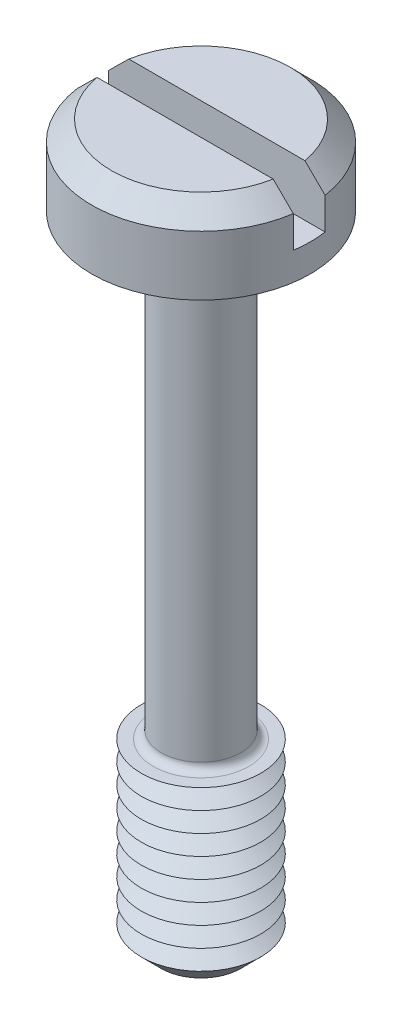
ISO-10303-21;
HEADER;
FILE_DESCRIPTION(('STEP AP214'),'2;1');
FILE_NAME('part.step','',(''),(''),'','','');
FILE_SCHEMA(('AUTOMOTIVE_DESIGN { 1 0 10303 214 1 1 1 1 }'));
ENDSEC;
DATA;
#1=APPLICATION_CONTEXT('core data for automotive mechanical design processes');
#2=APPLICATION_PROTOCOL_DEFINITION('international standard','automotive_design',2000,#1);
#3=PRODUCT_CONTEXT('',#1,'mechanical');
#4=PRODUCT('Part','Part','',(#3));
#5=PRODUCT_RELATED_PRODUCT_CATEGORY('part','',(#4));
#6=PRODUCT_DEFINITION_FORMATION('','',#4);
#7=PRODUCT_DEFINITION_CONTEXT('part definition',#1,'design');
#8=PRODUCT_DEFINITION('design','',#6,#7);
#9=PRODUCT_DEFINITION_SHAPE('','',#8);
#10=(LENGTH_UNIT() NAMED_UNIT(*) SI_UNIT(.MILLI.,.METRE.));
#11=(NAMED_UNIT(*) PLANE_ANGLE_UNIT() SI_UNIT($,.RADIAN.));
#12=(NAMED_UNIT(*) SI_UNIT($,.STERADIAN.) SOLID_ANGLE_UNIT());
#13=UNCERTAINTY_MEASURE_WITH_UNIT(LENGTH_MEASURE(1.E-05),#10,'distance_accuracy_value','');
#14=(GEOMETRIC_REPRESENTATION_CONTEXT(3) GLOBAL_UNCERTAINTY_ASSIGNED_CONTEXT((#13)) GLOBAL_UNIT_ASSIGNED_CONTEXT((#10,
#11,#12)) REPRESENTATION_CONTEXT('',''));
#15=CARTESIAN_POINT('',(0.,0.,0.));
#16=DIRECTION('',(0.,0.,1.));
#17=DIRECTION('',(1.,0.,0.));
#18=AXIS2_PLACEMENT_3D('',#15,#16,#17);
#19=CARTESIAN_POINT('',(0.,2.,0.));
#20=DIRECTION('',(0.,1.,0.));
#21=DIRECTION('',(0.,0.,1.));
#22=AXIS2_PLACEMENT_3D('',#19,#20,#21);
#23=PLANE('',#22);
#24=DIRECTION('',(-1.,0.,0.));
#25=VECTOR('',#24,1.);
#26=CARTESIAN_POINT('',(2.75,2.,-0.4));
#27=LINE('',#26,#25);
#28=CARTESIAN_POINT('',(2.21415898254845,2.,-0.4));
#29=VERTEX_POINT('',#28);
#30=CARTESIAN_POINT('',(-2.21415898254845,2.,-0.4));
#31=VERTEX_POINT('',#30);
#32=EDGE_CURVE('E110',#29,#31,#27,.T.);
#33=ORIENTED_EDGE('',*,*,#32,.F.);
#34=CARTESIAN_POINT('',(0.,2.,0.));
#35=DIRECTION('',(0.,1.,0.));
#36=DIRECTION('',(0.,0.,1.));
#37=AXIS2_PLACEMENT_3D('',#34,#35,#36);
#38=CIRCLE('',#37,2.25);
#39=EDGE_CURVE('E113',#29,#31,#38,.T.);
#40=ORIENTED_EDGE('',*,*,#39,.T.);
#41=EDGE_LOOP('',(#33,#40));
#42=FACE_BOUND('',#41,.T.);
#43=ADVANCED_FACE('F39',(#42),#23,.T.);
#44=CARTESIAN_POINT('',(0.,2.,0.));
#45=DIRECTION('',(0.,-1.,0.));
#46=DIRECTION('',(0.,0.,-1.));
#47=AXIS2_PLACEMENT_3D('',#44,#45,#46);
#48=CONICAL_SURFACE('',#47,2.25,0.785398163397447);
#49=CARTESIAN_POINT('',(6.05060089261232,-1.81380830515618,-0.4));
#50=CARTESIAN_POINT('',(5.84217393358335,-1.60583904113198,-0.4));
#51=CARTESIAN_POINT('',(5.63372707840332,-1.3978896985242,-0.4));
#52=CARTESIAN_POINT('',(5.21676338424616,-0.982052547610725,-0.4));
#53=CARTESIAN_POINT('',(5.0082465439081,-0.774164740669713,-0.4));
#54=CARTESIAN_POINT('',(4.59102343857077,-0.358383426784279,-0.4));
#55=CARTESIAN_POINT('',(4.38231713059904,-0.1504899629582,-0.4));
#56=CARTESIAN_POINT('',(3.96477014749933,0.265153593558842,-0.4));
#57=CARTESIAN_POINT('',(3.75592947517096,0.47290368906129,-0.4));
#58=CARTESIAN_POINT('',(3.33589913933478,0.890287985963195,-0.4));
#59=CARTESIAN_POINT('',(3.12470717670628,1.09991987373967,-0.4));
#60=CARTESIAN_POINT('',(2.7019134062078,1.51879562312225,-0.4));
#61=CARTESIAN_POINT('',(2.49031157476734,1.72803946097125,-0.4));
#62=CARTESIAN_POINT('',(2.17231429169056,2.04123939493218,-0.4));
#63=CARTESIAN_POINT('',(2.06623184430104,2.14551302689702,-0.4));
#64=CARTESIAN_POINT('',(1.85373145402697,2.35372301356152,-0.4));
#65=CARTESIAN_POINT('',(1.74731350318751,2.45765936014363,-0.4));
#66=CARTESIAN_POINT('',(1.53394692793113,2.6649644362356,-0.4));
#67=CARTESIAN_POINT('',(1.42699836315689,2.76833322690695,-0.4));
#68=CARTESIAN_POINT('',(1.26580938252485,2.92258234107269,-0.4));
#69=CARTESIAN_POINT('',(1.21195308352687,2.97386371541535,-0.4));
#70=CARTESIAN_POINT('',(1.10386632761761,3.07603025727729,-0.4));
#71=CARTESIAN_POINT('',(1.0496358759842,3.12691543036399,-0.4));
#72=CARTESIAN_POINT('',(0.965529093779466,3.20495157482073,-0.4));
#73=CARTESIAN_POINT('',(0.935852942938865,3.23231811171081,-0.4));
#74=CARTESIAN_POINT('',(0.876282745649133,3.28681446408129,-0.4));
#75=CARTESIAN_POINT('',(0.846388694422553,3.31394427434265,-0.4));
#76=CARTESIAN_POINT('',(0.786319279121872,3.36788760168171,-0.4));
#77=CARTESIAN_POINT('',(0.75614393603,3.39470114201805,-0.4));
#78=CARTESIAN_POINT('',(0.695411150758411,3.44788757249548,-0.4));
#79=CARTESIAN_POINT('',(0.664853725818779,3.4742604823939,-0.4));
#80=CARTESIAN_POINT('',(0.587773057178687,3.53947080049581,-0.4));
#81=CARTESIAN_POINT('',(0.540923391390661,3.57793090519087,-0.4));
#82=CARTESIAN_POINT('',(0.469108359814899,3.63368803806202,-0.4));
#83=CARTESIAN_POINT('',(0.444902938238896,3.65195872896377,-0.4));
#84=CARTESIAN_POINT('',(0.39579650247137,3.68753467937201,-0.4));
#85=CARTESIAN_POINT('',(0.370895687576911,3.70484021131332,-0.4));
#86=CARTESIAN_POINT('',(0.315135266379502,3.74129905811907,-0.4));
#87=CARTESIAN_POINT('',(0.284069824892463,3.76014262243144,-0.4));
#88=CARTESIAN_POINT('',(0.220007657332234,3.79429188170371,-0.4));
#89=CARTESIAN_POINT('',(0.187014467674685,3.80960381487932,-0.4));
#90=CARTESIAN_POINT('',(0.129469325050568,3.83013103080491,-0.4));
#91=CARTESIAN_POINT('',(0.105533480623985,3.83700748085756,-0.4));
#92=CARTESIAN_POINT('',(0.0568861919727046,3.8466714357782,-0.4));
#93=CARTESIAN_POINT('',(0.0321777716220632,3.84947323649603,-0.4));
#94=CARTESIAN_POINT('',(-0.0174556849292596,3.8503913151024,-0.4));
#95=CARTESIAN_POINT('',(-0.0423811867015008,3.84848412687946,-0.4));
#96=CARTESIAN_POINT('',(-0.0915464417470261,3.8403829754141,-0.4));
#97=CARTESIAN_POINT('',(-0.11578417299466,3.83417751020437,-0.4));
#98=CARTESIAN_POINT('',(-0.164015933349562,3.81830420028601,-0.4));
#99=CARTESIAN_POINT('',(-0.187969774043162,3.80851974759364,-0.4));
#100=CARTESIAN_POINT('',(-0.234812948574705,3.78663483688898,-0.4));
#101=CARTESIAN_POINT('',(-0.25770025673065,3.77453017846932,-0.4));
#102=CARTESIAN_POINT('',(-0.302761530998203,3.74868049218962,-0.4));
#103=CARTESIAN_POINT('',(-0.324928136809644,3.73492286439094,-0.4));
#104=CARTESIAN_POINT('',(-0.368536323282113,3.70635481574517,-0.4));
#105=CARTESIAN_POINT('',(-0.389978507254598,3.69154530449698,-0.4));
#106=CARTESIAN_POINT('',(-0.457169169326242,3.64340388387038,-0.4));
#107=CARTESIAN_POINT('',(-0.501937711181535,3.60871473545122,-0.4));
#108=CARTESIAN_POINT('',(-0.590074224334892,3.53759028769,-0.4));
#109=CARTESIAN_POINT('',(-0.633441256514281,3.50115385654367,-0.4));
#110=CARTESIAN_POINT('',(-0.719371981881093,3.42718980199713,-0.4));
#111=CARTESIAN_POINT('',(-0.761934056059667,3.38966030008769,-0.4));
#112=CARTESIAN_POINT('',(-0.84646547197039,3.31396862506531,-0.4));
#113=CARTESIAN_POINT('',(-0.888434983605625,3.27580664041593,-0.4));
#114=CARTESIAN_POINT('',(-1.01351008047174,3.16091722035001,-0.4));
#115=CARTESIAN_POINT('',(-1.09603733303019,3.08356131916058,-0.4));
#116=CARTESIAN_POINT('',(-1.26020205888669,2.92809304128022,-0.4));
#117=CARTESIAN_POINT('',(-1.34184039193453,2.84998156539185,-0.4));
#118=CARTESIAN_POINT('',(-1.50425180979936,2.69362860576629,-0.4));
#119=CARTESIAN_POINT('',(-1.58502715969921,2.61538947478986,-0.4));
#120=CARTESIAN_POINT('',(-1.74627332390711,2.4585978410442,-0.4));
#121=CARTESIAN_POINT('',(-1.82674413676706,2.38004533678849,-0.4));
#122=CARTESIAN_POINT('',(-2.06785619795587,2.14407469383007,-0.4));
#123=CARTESIAN_POINT('',(-2.22819388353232,1.98634651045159,-0.4));
#124=CARTESIAN_POINT('',(-2.54852691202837,1.67040441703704,-0.4));
#125=CARTESIAN_POINT('',(-2.70852207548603,1.51219032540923,-0.4));
#126=CARTESIAN_POINT('',(-3.02826273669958,1.19551306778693,-0.4));
#127=CARTESIAN_POINT('',(-3.18800823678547,1.03704990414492,-0.4));
#128=CARTESIAN_POINT('',(-3.66699080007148,0.561455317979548,-0.4));
#129=CARTESIAN_POINT('',(-3.98599924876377,0.244093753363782,-0.4));
#130=CARTESIAN_POINT('',(-4.62369880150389,-0.390879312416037,-0.4));
#131=CARTESIAN_POINT('',(-4.94238993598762,-0.7084907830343,-0.4));
#132=CARTESIAN_POINT('',(-5.39262624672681,-1.15743192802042,-0.4));
#133=CARTESIAN_POINT('',(-5.52423897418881,-1.28869385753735,-0.4));
#134=CARTESIAN_POINT('',(-5.78743776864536,-1.55123695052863,-0.4));
#135=CARTESIAN_POINT('',(-5.91902383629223,-1.68251811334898,-0.4));
#136=CARTESIAN_POINT('',(-6.05060089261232,-1.81380830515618,-0.4));
#137=B_SPLINE_CURVE_WITH_KNOTS('',3,(#49,#50,#51,#52,#53,#54,#55,#56,#57,#58,#59,#60,#61,#62,
#63,#64,#65,#66,#67,#68,#69,#70,#71,#72,#73,#74,#75,#76,#77,#78,#79,#80,#81,#82,#83,#84,#85,#86,
#87,#88,#89,#90,#91,#92,#93,#94,#95,#96,#97,#98,#99,#100,#101,#102,#103,#104,#105,#106,#107,
#108,#109,#110,#111,#112,#113,#114,#115,#116,#117,#118,#119,#120,#121,#122,#123,#124,#125,#126,
#127,#128,#129,#130,#131,#132,#133,#134,#135,#136),.UNSPECIFIED.,.F.,.F.,(4,2,2,2,2,2,2,2,2,2,2,
2,2,2,2,2,2,2,2,2,2,2,2,2,2,2,2,2,2,2,2,2,2,2,2,2,2,2,2,2,2,2,2,4),(0.,0.883310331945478,
1.76663897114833,2.65038219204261,3.53410755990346,4.42681573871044,5.31957687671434,
5.76582544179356,6.21208466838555,6.65829482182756,6.88139126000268,7.10448455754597,
7.22558850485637,7.34669511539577,7.46779276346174,7.58888496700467,7.77066509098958,
7.86163037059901,7.95256984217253,8.06146372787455,8.17016376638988,8.24461141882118,
8.31879723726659,8.39335348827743,8.46811002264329,8.54555790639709,8.62314734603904,
8.70137101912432,8.77952785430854,8.94932745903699,9.11923857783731,9.28946128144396,
9.45963414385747,9.79895964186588,10.1379210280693,10.475282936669,10.8126464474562,
11.4873867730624,12.1624208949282,12.8374486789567,14.1873973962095,15.5372009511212,
16.0948428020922,16.6524687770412),.UNSPECIFIED.);
#138=CARTESIAN_POINT('',(2.72075357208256,1.5,-0.4));
#139=VERTEX_POINT('',#138);
#140=EDGE_CURVE('E259',#139,#29,#137,.T.);
#141=ORIENTED_EDGE('',*,*,#140,.F.);
#142=CARTESIAN_POINT('',(0.,1.5,0.));
#143=DIRECTION('',(0.,1.,0.));
#144=DIRECTION('',(0.,0.,1.));
#145=AXIS2_PLACEMENT_3D('',#142,#143,#144);
#146=CIRCLE('',#145,2.75);
#147=CARTESIAN_POINT('',(-2.72075357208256,1.5,-0.4));
#148=VERTEX_POINT('',#147);
#149=EDGE_CURVE('E127',#148,#139,#146,.F.);
#150=ORIENTED_EDGE('',*,*,#149,.F.);
#151=EDGE_CURVE('E102',#31,#148,#137,.T.);
#152=ORIENTED_EDGE('',*,*,#151,.F.);
#153=ORIENTED_EDGE('',*,*,#39,.F.);
#154=EDGE_LOOP('',(#141,#150,#152,#153));
#155=FACE_BOUND('',#154,.T.);
#156=ADVANCED_FACE('F221',(#155),#48,.T.);
#157=CARTESIAN_POINT('',(0.,-16.,0.));
#158=DIRECTION('',(0.,1.,0.));
#159=DIRECTION('',(0.,0.,1.));
#160=AXIS2_PLACEMENT_3D('',#157,#158,#159);
#161=CYLINDRICAL_SURFACE('',#160,1.);
#162=CARTESIAN_POINT('',(0.,-11.3,0.));
#163=DIRECTION('',(0.,-1.,0.));
#164=DIRECTION('',(0.,0.,-1.));
#165=AXIS2_PLACEMENT_3D('',#162,#163,#164);
#166=CIRCLE('',#165,1.);
#167=CARTESIAN_POINT('',(0.,-11.3,-1.));
#168=VERTEX_POINT('',#167);
#169=EDGE_CURVE('E122',#168,#168,#166,.F.);
#170=ORIENTED_EDGE('',*,*,#169,.T.);
#171=EDGE_LOOP('',(#170));
#172=FACE_BOUND('',#171,.T.);
#173=CARTESIAN_POINT('',(0.,-0.199999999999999,0.));
#174=DIRECTION('',(0.,1.,0.));
#175=DIRECTION('',(0.,0.,1.));
#176=AXIS2_PLACEMENT_3D('',#173,#174,#175);
#177=CIRCLE('',#176,1.);
#178=CARTESIAN_POINT('',(0.,-0.199999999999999,1.));
#179=VERTEX_POINT('',#178);
#180=EDGE_CURVE('E365',#179,#179,#177,.F.);
#181=ORIENTED_EDGE('',*,*,#180,.T.);
#182=EDGE_LOOP('',(#181));
#183=FACE_BOUND('',#182,.T.);
#184=ADVANCED_FACE('F217',(#172,#183),#161,.T.);
#185=CARTESIAN_POINT('',(0.,2.,0.));
#186=DIRECTION('',(0.,-1.,0.));
#187=DIRECTION('',(0.,0.,-1.));
#188=AXIS2_PLACEMENT_3D('',#185,#186,#187);
#189=CYLINDRICAL_SURFACE('',#188,2.75);
#190=ORIENTED_EDGE('',*,*,#149,.T.);
#191=DIRECTION('',(0.,-1.,0.));
#192=VECTOR('',#191,1.);
#193=CARTESIAN_POINT('',(2.72075357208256,2.,-0.4));
#194=LINE('',#193,#192);
#195=CARTESIAN_POINT('',(2.72075357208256,0.7,-0.4));
#196=VERTEX_POINT('',#195);
#197=EDGE_CURVE('E64',#139,#196,#194,.T.);
#198=ORIENTED_EDGE('',*,*,#197,.T.);
#199=CARTESIAN_POINT('',(0.,0.7,0.));
#200=DIRECTION('',(0.,1.,0.));
#201=DIRECTION('',(0.,0.,1.));
#202=AXIS2_PLACEMENT_3D('',#199,#200,#201);
#203=CIRCLE('',#202,2.75);
#204=CARTESIAN_POINT('',(2.72075357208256,0.7,0.4));
#205=VERTEX_POINT('',#204);
#206=EDGE_CURVE('E11',#205,#196,#203,.T.);
#207=ORIENTED_EDGE('',*,*,#206,.F.);
#208=DIRECTION('',(0.,-1.,0.));
#209=VECTOR('',#208,1.);
#210=CARTESIAN_POINT('',(2.72075357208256,2.,0.4));
#211=LINE('',#210,#209);
#212=CARTESIAN_POINT('',(2.72075357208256,1.5,0.4));
#213=VERTEX_POINT('',#212);
#214=EDGE_CURVE('E277',#205,#213,#211,.F.);
#215=ORIENTED_EDGE('',*,*,#214,.T.);
#216=CARTESIAN_POINT('',(-2.72075357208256,1.5,0.4));
#217=VERTEX_POINT('',#216);
#218=EDGE_CURVE('E119',#213,#217,#146,.F.);
#219=ORIENTED_EDGE('',*,*,#218,.T.);
#220=DIRECTION('',(0.,-1.,0.));
#221=VECTOR('',#220,1.);
#222=CARTESIAN_POINT('',(-2.72075357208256,2.,0.4));
#223=LINE('',#222,#221);
#224=CARTESIAN_POINT('',(-2.72075357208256,0.7,0.4));
#225=VERTEX_POINT('',#224);
#226=EDGE_CURVE('E96',#217,#225,#223,.T.);
#227=ORIENTED_EDGE('',*,*,#226,.T.);
#228=CARTESIAN_POINT('',(-2.72075357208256,0.7,-0.4));
#229=VERTEX_POINT('',#228);
#230=EDGE_CURVE('E44',#229,#225,#203,.T.);
#231=ORIENTED_EDGE('',*,*,#230,.F.);
#232=DIRECTION('',(0.,-1.,0.));
#233=VECTOR('',#232,1.);
#234=CARTESIAN_POINT('',(-2.72075357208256,2.,-0.4));
#235=LINE('',#234,#233);
#236=EDGE_CURVE('E282',#229,#148,#235,.F.);
#237=ORIENTED_EDGE('',*,*,#236,.T.);
#238=EDGE_LOOP('',(#190,#198,#207,#215,#219,#227,#231,#237));
#239=FACE_BOUND('',#238,.T.);
#240=CARTESIAN_POINT('',(0.,0.,0.));
#241=DIRECTION('',(0.,1.,0.));
#242=DIRECTION('',(0.,0.,1.));
#243=AXIS2_PLACEMENT_3D('',#240,#241,#242);
#244=CIRCLE('',#243,2.75);
#245=CARTESIAN_POINT('',(0.,0.,2.75));
#246=VERTEX_POINT('',#245);
#247=EDGE_CURVE('E353',#246,#246,#244,.T.);
#248=ORIENTED_EDGE('',*,*,#247,.T.);
#249=EDGE_LOOP('',(#248));
#250=FACE_BOUND('',#249,.T.);
#251=ADVANCED_FACE('F220',(#239,#250),#189,.T.);
#252=DIRECTION('',(1.,0.,0.));
#253=VECTOR('',#252,1.);
#254=CARTESIAN_POINT('',(2.75,2.,0.4));
#255=LINE('',#254,#253);
#256=CARTESIAN_POINT('',(-2.21415898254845,2.,0.4));
#257=VERTEX_POINT('',#256);
#258=CARTESIAN_POINT('',(2.21415898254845,2.,0.4));
#259=VERTEX_POINT('',#258);
#260=EDGE_CURVE('E56',#257,#259,#255,.T.);
#261=ORIENTED_EDGE('',*,*,#260,.F.);
#262=EDGE_CURVE('E108',#257,#259,#38,.T.);
#263=ORIENTED_EDGE('',*,*,#262,.T.);
#264=EDGE_LOOP('',(#261,#263));
#265=FACE_BOUND('',#264,.T.);
#266=ADVANCED_FACE('F107',(#265),#23,.T.);
#267=CARTESIAN_POINT('',(0.,0.,0.));
#268=DIRECTION('',(0.,1.,0.));
#269=DIRECTION('',(0.,0.,1.));
#270=AXIS2_PLACEMENT_3D('',#267,#268,#269);
#271=PLANE('',#270);
#272=CARTESIAN_POINT('',(0.,0.,0.));
#273=DIRECTION('',(0.,1.,0.));
#274=DIRECTION('',(0.,0.,1.));
#275=AXIS2_PLACEMENT_3D('',#272,#273,#274);
#276=CIRCLE('',#275,1.2);
#277=CARTESIAN_POINT('',(0.,0.,1.2));
#278=VERTEX_POINT('',#277);
#279=EDGE_CURVE('E114',#278,#278,#276,.T.);
#280=ORIENTED_EDGE('',*,*,#279,.T.);
#281=EDGE_LOOP('',(#280));
#282=FACE_BOUND('',#281,.T.);
#283=ORIENTED_EDGE('',*,*,#247,.F.);
#284=EDGE_LOOP('',(#283));
#285=FACE_BOUND('',#284,.T.);
#286=ADVANCED_FACE('F211',(#282,#285),#271,.F.);
#287=CARTESIAN_POINT('',(0.,-11.5,0.));
#288=DIRECTION('',(0.,-1.,0.));
#289=DIRECTION('',(0.,0.,-1.));
#290=AXIS2_PLACEMENT_3D('',#287,#288,#289);
#291=PLANE('',#290);
#292=CARTESIAN_POINT('',(0.,-11.5,0.));
#293=DIRECTION('',(0.,-1.,0.));
#294=DIRECTION('',(0.,0.,-1.));
#295=AXIS2_PLACEMENT_3D('',#292,#293,#294);
#296=CIRCLE('',#295,1.2);
#297=CARTESIAN_POINT('',(0.,-11.5,-1.2));
#298=VERTEX_POINT('',#297);
#299=EDGE_CURVE('E361',#298,#298,#296,.T.);
#300=ORIENTED_EDGE('',*,*,#299,.T.);
#301=EDGE_LOOP('',(#300));
#302=FACE_BOUND('',#301,.T.);
#303=CARTESIAN_POINT('',(0.,-11.5,0.));
#304=DIRECTION('',(0.,1.,0.));
#305=DIRECTION('',(0.,0.,1.));
#306=AXIS2_PLACEMENT_3D('',#303,#304,#305);
#307=CIRCLE('',#306,1.5);
#308=CARTESIAN_POINT('',(0.,-11.5,1.5));
#309=VERTEX_POINT('',#308);
#310=EDGE_CURVE('E350',#309,#309,#307,.T.);
#311=ORIENTED_EDGE('',*,*,#310,.T.);
#312=EDGE_LOOP('',(#311));
#313=FACE_BOUND('',#312,.T.);
#314=ADVANCED_FACE('F207',(#302,#313),#291,.F.);
#315=CARTESIAN_POINT('',(0.,-11.75,0.));
#316=DIRECTION('',(0.,1.,0.));
#317=DIRECTION('',(0.,0.,1.));
#318=AXIS2_PLACEMENT_3D('',#315,#316,#317);
#319=CONICAL_SURFACE('',#318,1.06698729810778,1.0471975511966);
#320=ORIENTED_EDGE('',*,*,#310,.F.);
#321=EDGE_LOOP('',(#320));
#322=FACE_BOUND('',#321,.T.);
#323=CARTESIAN_POINT('',(0.,-11.75,0.));
#324=DIRECTION('',(0.,1.,0.));
#325=DIRECTION('',(0.,0.,1.));
#326=AXIS2_PLACEMENT_3D('',#323,#324,#325);
#327=CIRCLE('',#326,1.06698729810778);
#328=CARTESIAN_POINT('',(0.,-11.75,1.06698729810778));
#329=VERTEX_POINT('',#328);
#330=EDGE_CURVE('E346',#329,#329,#327,.T.);
#331=ORIENTED_EDGE('',*,*,#330,.T.);
#332=EDGE_LOOP('',(#331));
#333=FACE_BOUND('',#332,.T.);
#334=ADVANCED_FACE('F203',(#322,#333),#319,.T.);
#335=CARTESIAN_POINT('',(0.,-12.,0.));
#336=DIRECTION('',(0.,-1.,0.));
#337=DIRECTION('',(0.,0.,-1.));
#338=AXIS2_PLACEMENT_3D('',#335,#336,#337);
#339=CONICAL_SURFACE('',#338,1.5,1.0471975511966);
#340=ORIENTED_EDGE('',*,*,#330,.F.);
#341=EDGE_LOOP('',(#340));
#342=FACE_BOUND('',#341,.T.);
#343=CARTESIAN_POINT('',(0.,-12.,0.));
#344=DIRECTION('',(0.,1.,0.));
#345=DIRECTION('',(0.,0.,1.));
#346=AXIS2_PLACEMENT_3D('',#343,#344,#345);
#347=CIRCLE('',#346,1.5);
#348=CARTESIAN_POINT('',(0.,-12.,1.5));
#349=VERTEX_POINT('',#348);
#350=EDGE_CURVE('E342',#349,#349,#347,.T.);
#351=ORIENTED_EDGE('',*,*,#350,.T.);
#352=EDGE_LOOP('',(#351));
#353=FACE_BOUND('',#352,.T.);
#354=ADVANCED_FACE('F199',(#342,#353),#339,.T.);
#355=CARTESIAN_POINT('',(0.,-12.25,0.));
#356=DIRECTION('',(0.,1.,0.));
#357=DIRECTION('',(0.,0.,1.));
#358=AXIS2_PLACEMENT_3D('',#355,#356,#357);
#359=CONICAL_SURFACE('',#358,1.06698729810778,1.0471975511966);
#360=ORIENTED_EDGE('',*,*,#350,.F.);
#361=EDGE_LOOP('',(#360));
#362=FACE_BOUND('',#361,.T.);
#363=CARTESIAN_POINT('',(0.,-12.25,0.));
#364=DIRECTION('',(0.,1.,0.));
#365=DIRECTION('',(0.,0.,1.));
#366=AXIS2_PLACEMENT_3D('',#363,#364,#365);
#367=CIRCLE('',#366,1.06698729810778);
#368=CARTESIAN_POINT('',(0.,-12.25,1.06698729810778));
#369=VERTEX_POINT('',#368);
#370=EDGE_CURVE('E339',#369,#369,#367,.T.);
#371=ORIENTED_EDGE('',*,*,#370,.T.);
#372=EDGE_LOOP('',(#371));
#373=FACE_BOUND('',#372,.T.);
#374=ADVANCED_FACE('F195',(#362,#373),#359,.T.);
#375=CARTESIAN_POINT('',(0.,-12.5,0.));
#376=DIRECTION('',(0.,-1.,0.));
#377=DIRECTION('',(0.,0.,-1.));
#378=AXIS2_PLACEMENT_3D('',#375,#376,#377);
#379=CONICAL_SURFACE('',#378,1.5,1.0471975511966);
#380=ORIENTED_EDGE('',*,*,#370,.F.);
#381=EDGE_LOOP('',(#380));
#382=FACE_BOUND('',#381,.T.);
#383=CARTESIAN_POINT('',(0.,-12.5,0.));
#384=DIRECTION('',(0.,1.,0.));
#385=DIRECTION('',(0.,0.,1.));
#386=AXIS2_PLACEMENT_3D('',#383,#384,#385);
#387=CIRCLE('',#386,1.5);
#388=CARTESIAN_POINT('',(0.,-12.5,1.5));
#389=VERTEX_POINT('',#388);
#390=EDGE_CURVE('E335',#389,#389,#387,.T.);
#391=ORIENTED_EDGE('',*,*,#390,.T.);
#392=EDGE_LOOP('',(#391));
#393=FACE_BOUND('',#392,.T.);
#394=ADVANCED_FACE('F191',(#382,#393),#379,.T.);
#395=CARTESIAN_POINT('',(0.,-12.75,0.));
#396=DIRECTION('',(0.,1.,0.));
#397=DIRECTION('',(0.,0.,1.));
#398=AXIS2_PLACEMENT_3D('',#395,#396,#397);
#399=CONICAL_SURFACE('',#398,1.06698729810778,1.0471975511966);
#400=ORIENTED_EDGE('',*,*,#390,.F.);
#401=EDGE_LOOP('',(#400));
#402=FACE_BOUND('',#401,.T.);
#403=CARTESIAN_POINT('',(0.,-12.75,0.));
#404=DIRECTION('',(0.,1.,0.));
#405=DIRECTION('',(0.,0.,1.));
#406=AXIS2_PLACEMENT_3D('',#403,#404,#405);
#407=CIRCLE('',#406,1.06698729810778);
#408=CARTESIAN_POINT('',(0.,-12.75,1.06698729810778));
#409=VERTEX_POINT('',#408);
#410=EDGE_CURVE('E331',#409,#409,#407,.T.);
#411=ORIENTED_EDGE('',*,*,#410,.T.);
#412=EDGE_LOOP('',(#411));
#413=FACE_BOUND('',#412,.T.);
#414=ADVANCED_FACE('F187',(#402,#413),#399,.T.);
#415=CARTESIAN_POINT('',(0.,-13.,0.));
#416=DIRECTION('',(0.,-1.,0.));
#417=DIRECTION('',(0.,0.,-1.));
#418=AXIS2_PLACEMENT_3D('',#415,#416,#417);
#419=CONICAL_SURFACE('',#418,1.5,1.0471975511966);
#420=ORIENTED_EDGE('',*,*,#410,.F.);
#421=EDGE_LOOP('',(#420));
#422=FACE_BOUND('',#421,.T.);
#423=CARTESIAN_POINT('',(0.,-13.,0.));
#424=DIRECTION('',(0.,1.,0.));
#425=DIRECTION('',(0.,0.,1.));
#426=AXIS2_PLACEMENT_3D('',#423,#424,#425);
#427=CIRCLE('',#426,1.5);
#428=CARTESIAN_POINT('',(0.,-13.,1.5));
#429=VERTEX_POINT('',#428);
#430=EDGE_CURVE('E328',#429,#429,#427,.T.);
#431=ORIENTED_EDGE('',*,*,#430,.T.);
#432=EDGE_LOOP('',(#431));
#433=FACE_BOUND('',#432,.T.);
#434=ADVANCED_FACE('F183',(#422,#433),#419,.T.);
#435=CARTESIAN_POINT('',(0.,-13.25,0.));
#436=DIRECTION('',(0.,1.,0.));
#437=DIRECTION('',(0.,0.,1.));
#438=AXIS2_PLACEMENT_3D('',#435,#436,#437);
#439=CONICAL_SURFACE('',#438,1.06698729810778,1.0471975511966);
#440=ORIENTED_EDGE('',*,*,#430,.F.);
#441=EDGE_LOOP('',(#440));
#442=FACE_BOUND('',#441,.T.);
#443=CARTESIAN_POINT('',(0.,-13.25,0.));
#444=DIRECTION('',(0.,1.,0.));
#445=DIRECTION('',(0.,0.,1.));
#446=AXIS2_PLACEMENT_3D('',#443,#444,#445);
#447=CIRCLE('',#446,1.06698729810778);
#448=CARTESIAN_POINT('',(0.,-13.25,1.06698729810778));
#449=VERTEX_POINT('',#448);
#450=EDGE_CURVE('E325',#449,#449,#447,.T.);
#451=ORIENTED_EDGE('',*,*,#450,.T.);
#452=EDGE_LOOP('',(#451));
#453=FACE_BOUND('',#452,.T.);
#454=ADVANCED_FACE('F179',(#442,#453),#439,.T.);
#455=CARTESIAN_POINT('',(0.,-13.5,0.));
#456=DIRECTION('',(0.,-1.,0.));
#457=DIRECTION('',(0.,0.,-1.));
#458=AXIS2_PLACEMENT_3D('',#455,#456,#457);
#459=CONICAL_SURFACE('',#458,1.5,1.0471975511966);
#460=ORIENTED_EDGE('',*,*,#450,.F.);
#461=EDGE_LOOP('',(#460));
#462=FACE_BOUND('',#461,.T.);
#463=CARTESIAN_POINT('',(0.,-13.5,0.));
#464=DIRECTION('',(0.,1.,0.));
#465=DIRECTION('',(0.,0.,1.));
#466=AXIS2_PLACEMENT_3D('',#463,#464,#465);
#467=CIRCLE('',#466,1.5);
#468=CARTESIAN_POINT('',(0.,-13.5,1.5));
#469=VERTEX_POINT('',#468);
#470=EDGE_CURVE('E321',#469,#469,#467,.T.);
#471=ORIENTED_EDGE('',*,*,#470,.T.);
#472=EDGE_LOOP('',(#471));
#473=FACE_BOUND('',#472,.T.);
#474=ADVANCED_FACE('F175',(#462,#473),#459,.T.);
#475=CARTESIAN_POINT('',(0.,-13.75,0.));
#476=DIRECTION('',(0.,1.,0.));
#477=DIRECTION('',(0.,0.,1.));
#478=AXIS2_PLACEMENT_3D('',#475,#476,#477);
#479=CONICAL_SURFACE('',#478,1.06698729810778,1.0471975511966);
#480=ORIENTED_EDGE('',*,*,#470,.F.);
#481=EDGE_LOOP('',(#480));
#482=FACE_BOUND('',#481,.T.);
#483=CARTESIAN_POINT('',(0.,-13.75,0.));
#484=DIRECTION('',(0.,1.,0.));
#485=DIRECTION('',(0.,0.,1.));
#486=AXIS2_PLACEMENT_3D('',#483,#484,#485);
#487=CIRCLE('',#486,1.06698729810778);
#488=CARTESIAN_POINT('',(0.,-13.75,1.06698729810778));
#489=VERTEX_POINT('',#488);
#490=EDGE_CURVE('E317',#489,#489,#487,.T.);
#491=ORIENTED_EDGE('',*,*,#490,.T.);
#492=EDGE_LOOP('',(#491));
#493=FACE_BOUND('',#492,.T.);
#494=ADVANCED_FACE('F171',(#482,#493),#479,.T.);
#495=CARTESIAN_POINT('',(0.,-14.,0.));
#496=DIRECTION('',(0.,-1.,0.));
#497=DIRECTION('',(0.,0.,-1.));
#498=AXIS2_PLACEMENT_3D('',#495,#496,#497);
#499=CONICAL_SURFACE('',#498,1.5,1.0471975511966);
#500=ORIENTED_EDGE('',*,*,#490,.F.);
#501=EDGE_LOOP('',(#500));
#502=FACE_BOUND('',#501,.T.);
#503=CARTESIAN_POINT('',(0.,-14.,0.));
#504=DIRECTION('',(0.,1.,0.));
#505=DIRECTION('',(0.,0.,1.));
#506=AXIS2_PLACEMENT_3D('',#503,#504,#505);
#507=CIRCLE('',#506,1.5);
#508=CARTESIAN_POINT('',(0.,-14.,1.5));
#509=VERTEX_POINT('',#508);
#510=EDGE_CURVE('E314',#509,#509,#507,.T.);
#511=ORIENTED_EDGE('',*,*,#510,.T.);
#512=EDGE_LOOP('',(#511));
#513=FACE_BOUND('',#512,.T.);
#514=ADVANCED_FACE('F167',(#502,#513),#499,.T.);
#515=CARTESIAN_POINT('',(0.,-14.25,0.));
#516=DIRECTION('',(0.,1.,0.));
#517=DIRECTION('',(0.,0.,1.));
#518=AXIS2_PLACEMENT_3D('',#515,#516,#517);
#519=CONICAL_SURFACE('',#518,1.06698729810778,1.0471975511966);
#520=ORIENTED_EDGE('',*,*,#510,.F.);
#521=EDGE_LOOP('',(#520));
#522=FACE_BOUND('',#521,.T.);
#523=CARTESIAN_POINT('',(0.,-14.25,0.));
#524=DIRECTION('',(0.,1.,0.));
#525=DIRECTION('',(0.,0.,1.));
#526=AXIS2_PLACEMENT_3D('',#523,#524,#525);
#527=CIRCLE('',#526,1.06698729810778);
#528=CARTESIAN_POINT('',(0.,-14.25,1.06698729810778));
#529=VERTEX_POINT('',#528);
#530=EDGE_CURVE('E310',#529,#529,#527,.T.);
#531=ORIENTED_EDGE('',*,*,#530,.T.);
#532=EDGE_LOOP('',(#531));
#533=FACE_BOUND('',#532,.T.);
#534=ADVANCED_FACE('F163',(#522,#533),#519,.T.);
#535=CARTESIAN_POINT('',(0.,-14.5,0.));
#536=DIRECTION('',(0.,-1.,0.));
#537=DIRECTION('',(0.,0.,-1.));
#538=AXIS2_PLACEMENT_3D('',#535,#536,#537);
#539=CONICAL_SURFACE('',#538,1.5,1.0471975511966);
#540=ORIENTED_EDGE('',*,*,#530,.F.);
#541=EDGE_LOOP('',(#540));
#542=FACE_BOUND('',#541,.T.);
#543=CARTESIAN_POINT('',(0.,-14.5,0.));
#544=DIRECTION('',(0.,1.,0.));
#545=DIRECTION('',(0.,0.,1.));
#546=AXIS2_PLACEMENT_3D('',#543,#544,#545);
#547=CIRCLE('',#546,1.5);
#548=CARTESIAN_POINT('',(0.,-14.5,1.5));
#549=VERTEX_POINT('',#548);
#550=EDGE_CURVE('E306',#549,#549,#547,.T.);
#551=ORIENTED_EDGE('',*,*,#550,.T.);
#552=EDGE_LOOP('',(#551));
#553=FACE_BOUND('',#552,.T.);
#554=ADVANCED_FACE('F159',(#542,#553),#539,.T.);
#555=CARTESIAN_POINT('',(0.,-14.75,0.));
#556=DIRECTION('',(0.,1.,0.));
#557=DIRECTION('',(0.,0.,1.));
#558=AXIS2_PLACEMENT_3D('',#555,#556,#557);
#559=CONICAL_SURFACE('',#558,1.06698729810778,1.0471975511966);
#560=ORIENTED_EDGE('',*,*,#550,.F.);
#561=EDGE_LOOP('',(#560));
#562=FACE_BOUND('',#561,.T.);
#563=CARTESIAN_POINT('',(0.,-14.75,0.));
#564=DIRECTION('',(0.,1.,0.));
#565=DIRECTION('',(0.,0.,1.));
#566=AXIS2_PLACEMENT_3D('',#563,#564,#565);
#567=CIRCLE('',#566,1.06698729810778);
#568=CARTESIAN_POINT('',(0.,-14.75,1.06698729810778));
#569=VERTEX_POINT('',#568);
#570=EDGE_CURVE('E302',#569,#569,#567,.T.);
#571=ORIENTED_EDGE('',*,*,#570,.T.);
#572=EDGE_LOOP('',(#571));
#573=FACE_BOUND('',#572,.T.);
#574=ADVANCED_FACE('F155',(#562,#573),#559,.T.);
#575=CARTESIAN_POINT('',(0.,-15.,0.));
#576=DIRECTION('',(0.,-1.,0.));
#577=DIRECTION('',(0.,0.,-1.));
#578=AXIS2_PLACEMENT_3D('',#575,#576,#577);
#579=CONICAL_SURFACE('',#578,1.5,1.0471975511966);
#580=ORIENTED_EDGE('',*,*,#570,.F.);
#581=EDGE_LOOP('',(#580));
#582=FACE_BOUND('',#581,.T.);
#583=CARTESIAN_POINT('',(0.,-15.,0.));
#584=DIRECTION('',(0.,1.,0.));
#585=DIRECTION('',(0.,0.,1.));
#586=AXIS2_PLACEMENT_3D('',#583,#584,#585);
#587=CIRCLE('',#586,1.5);
#588=CARTESIAN_POINT('',(0.,-15.,1.5));
#589=VERTEX_POINT('',#588);
#590=EDGE_CURVE('E299',#589,#589,#587,.T.);
#591=ORIENTED_EDGE('',*,*,#590,.T.);
#592=EDGE_LOOP('',(#591));
#593=FACE_BOUND('',#592,.T.);
#594=ADVANCED_FACE('F151',(#582,#593),#579,.T.);
#595=CARTESIAN_POINT('',(0.,-15.25,0.));
#596=DIRECTION('',(0.,1.,0.));
#597=DIRECTION('',(0.,0.,1.));
#598=AXIS2_PLACEMENT_3D('',#595,#596,#597);
#599=CONICAL_SURFACE('',#598,1.06698729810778,1.0471975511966);
#600=ORIENTED_EDGE('',*,*,#590,.F.);
#601=EDGE_LOOP('',(#600));
#602=FACE_BOUND('',#601,.T.);
#603=CARTESIAN_POINT('',(0.,-15.25,0.));
#604=DIRECTION('',(0.,1.,0.));
#605=DIRECTION('',(0.,0.,1.));
#606=AXIS2_PLACEMENT_3D('',#603,#604,#605);
#607=CIRCLE('',#606,1.06698729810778);
#608=CARTESIAN_POINT('',(0.,-15.25,1.06698729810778));
#609=VERTEX_POINT('',#608);
#610=EDGE_CURVE('E295',#609,#609,#607,.T.);
#611=ORIENTED_EDGE('',*,*,#610,.T.);
#612=EDGE_LOOP('',(#611));
#613=FACE_BOUND('',#612,.T.);
#614=ADVANCED_FACE('F147',(#602,#613),#599,.T.);
#615=CARTESIAN_POINT('',(0.,-15.5,0.));
#616=DIRECTION('',(0.,-1.,0.));
#617=DIRECTION('',(0.,0.,-1.));
#618=AXIS2_PLACEMENT_3D('',#615,#616,#617);
#619=CONICAL_SURFACE('',#618,1.5,1.0471975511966);
#620=ORIENTED_EDGE('',*,*,#610,.F.);
#621=EDGE_LOOP('',(#620));
#622=FACE_BOUND('',#621,.T.);
#623=CARTESIAN_POINT('',(0.,-15.5,0.));
#624=DIRECTION('',(0.,1.,0.));
#625=DIRECTION('',(0.,0.,1.));
#626=AXIS2_PLACEMENT_3D('',#623,#624,#625);
#627=CIRCLE('',#626,1.5);
#628=CARTESIAN_POINT('',(0.,-15.5,1.5));
#629=VERTEX_POINT('',#628);
#630=EDGE_CURVE('E291',#629,#629,#627,.T.);
#631=ORIENTED_EDGE('',*,*,#630,.T.);
#632=EDGE_LOOP('',(#631));
#633=FACE_BOUND('',#632,.T.);
#634=ADVANCED_FACE('F143',(#622,#633),#619,.T.);
#635=CARTESIAN_POINT('',(0.,-16.,0.));
#636=DIRECTION('',(0.,-1.,0.));
#637=DIRECTION('',(0.,0.,-1.));
#638=AXIS2_PLACEMENT_3D('',#635,#636,#637);
#639=PLANE('',#638);
#640=CARTESIAN_POINT('',(0.,-16.,0.));
#641=DIRECTION('',(0.,-1.,0.));
#642=DIRECTION('',(0.,0.,-1.));
#643=AXIS2_PLACEMENT_3D('',#640,#641,#642);
#644=CIRCLE('',#643,0.999999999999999);
#645=CARTESIAN_POINT('',(0.,-16.,-0.999999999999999));
#646=VERTEX_POINT('',#645);
#647=EDGE_CURVE('E357',#646,#646,#644,.T.);
#648=ORIENTED_EDGE('',*,*,#647,.T.);
#649=EDGE_LOOP('',(#648));
#650=FACE_BOUND('',#649,.T.);
#651=ADVANCED_FACE('F146',(#650),#639,.T.);
#652=CARTESIAN_POINT('',(0.,-16.,0.));
#653=DIRECTION('',(0.,1.,0.));
#654=DIRECTION('',(0.,0.,1.));
#655=AXIS2_PLACEMENT_3D('',#652,#653,#654);
#656=CONICAL_SURFACE('',#655,0.999999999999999,0.785398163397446);
#657=ORIENTED_EDGE('',*,*,#630,.F.);
#658=EDGE_LOOP('',(#657));
#659=FACE_BOUND('',#658,.T.);
#660=ORIENTED_EDGE('',*,*,#647,.F.);
#661=EDGE_LOOP('',(#660));
#662=FACE_BOUND('',#661,.T.);
#663=ADVANCED_FACE('F215',(#659,#662),#656,.T.);
#664=CARTESIAN_POINT('',(0.,-11.3,0.));
#665=DIRECTION('',(0.,-1.,0.));
#666=DIRECTION('',(0.,0.,-1.));
#667=AXIS2_PLACEMENT_3D('',#664,#665,#666);
#668=TOROIDAL_SURFACE('',#667,1.2,0.2);
#669=ORIENTED_EDGE('',*,*,#169,.F.);
#670=EDGE_LOOP('',(#669));
#671=FACE_BOUND('',#670,.T.);
#672=ORIENTED_EDGE('',*,*,#299,.F.);
#673=EDGE_LOOP('',(#672));
#674=FACE_BOUND('',#673,.T.);
#675=ADVANCED_FACE('F233',(#671,#674),#668,.F.);
#676=CARTESIAN_POINT('',(0.,-0.199999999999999,0.));
#677=DIRECTION('',(0.,1.,0.));
#678=DIRECTION('',(0.,0.,1.));
#679=AXIS2_PLACEMENT_3D('',#676,#677,#678);
#680=TOROIDAL_SURFACE('',#679,1.2,0.2);
#681=ORIENTED_EDGE('',*,*,#279,.F.);
#682=EDGE_LOOP('',(#681));
#683=FACE_BOUND('',#682,.T.);
#684=ORIENTED_EDGE('',*,*,#180,.F.);
#685=EDGE_LOOP('',(#684));
#686=FACE_BOUND('',#685,.T.);
#687=ADVANCED_FACE('F236',(#683,#686),#680,.F.);
#688=CARTESIAN_POINT('',(-6.05060089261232,-1.81380830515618,0.4));
#689=CARTESIAN_POINT('',(-5.84217393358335,-1.60583904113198,0.4));
#690=CARTESIAN_POINT('',(-5.63372707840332,-1.39788969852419,0.4));
#691=CARTESIAN_POINT('',(-5.21676338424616,-0.982052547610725,0.4));
#692=CARTESIAN_POINT('',(-5.0082465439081,-0.774164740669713,0.4));
#693=CARTESIAN_POINT('',(-4.59102343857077,-0.35838342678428,0.4));
#694=CARTESIAN_POINT('',(-4.38231713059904,-0.150489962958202,0.4));
#695=CARTESIAN_POINT('',(-3.96477014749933,0.26515359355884,0.4));
#696=CARTESIAN_POINT('',(-3.75592947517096,0.472903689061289,0.4));
#697=CARTESIAN_POINT('',(-3.33589913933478,0.890287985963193,0.4));
#698=CARTESIAN_POINT('',(-3.12470717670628,1.09991987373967,0.4));
#699=CARTESIAN_POINT('',(-2.7019134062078,1.51879562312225,0.4));
#700=CARTESIAN_POINT('',(-2.49031157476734,1.72803946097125,0.4));
#701=CARTESIAN_POINT('',(-2.17231429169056,2.04123939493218,0.4));
#702=CARTESIAN_POINT('',(-2.06623184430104,2.14551302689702,0.4));
#703=CARTESIAN_POINT('',(-1.85373145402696,2.35372301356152,0.4));
#704=CARTESIAN_POINT('',(-1.74731350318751,2.45765936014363,0.4));
#705=CARTESIAN_POINT('',(-1.53394692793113,2.6649644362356,0.4));
#706=CARTESIAN_POINT('',(-1.42699836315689,2.76833322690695,0.4));
#707=CARTESIAN_POINT('',(-1.26580938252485,2.92258234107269,0.4));
#708=CARTESIAN_POINT('',(-1.21195308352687,2.97386371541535,0.4));
#709=CARTESIAN_POINT('',(-1.10386632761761,3.07603025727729,0.4));
#710=CARTESIAN_POINT('',(-1.0496358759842,3.12691543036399,0.4));
#711=CARTESIAN_POINT('',(-0.965529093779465,3.20495157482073,0.4));
#712=CARTESIAN_POINT('',(-0.935852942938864,3.23231811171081,0.4));
#713=CARTESIAN_POINT('',(-0.876282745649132,3.28681446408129,0.4));
#714=CARTESIAN_POINT('',(-0.846388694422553,3.31394427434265,0.4));
#715=CARTESIAN_POINT('',(-0.786319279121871,3.36788760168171,0.4));
#716=CARTESIAN_POINT('',(-0.756143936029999,3.39470114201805,0.4));
#717=CARTESIAN_POINT('',(-0.69541115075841,3.44788757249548,0.4));
#718=CARTESIAN_POINT('',(-0.664853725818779,3.4742604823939,0.4));
#719=CARTESIAN_POINT('',(-0.587773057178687,3.53947080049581,0.4));
#720=CARTESIAN_POINT('',(-0.540923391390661,3.57793090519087,0.4));
#721=CARTESIAN_POINT('',(-0.469108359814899,3.63368803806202,0.4));
#722=CARTESIAN_POINT('',(-0.444902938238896,3.65195872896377,0.4));
#723=CARTESIAN_POINT('',(-0.39579650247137,3.68753467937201,0.4));
#724=CARTESIAN_POINT('',(-0.370895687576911,3.70484021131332,0.4));
#725=CARTESIAN_POINT('',(-0.315135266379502,3.74129905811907,0.4));
#726=CARTESIAN_POINT('',(-0.284069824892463,3.76014262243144,0.4));
#727=CARTESIAN_POINT('',(-0.220007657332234,3.79429188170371,0.4));
#728=CARTESIAN_POINT('',(-0.187014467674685,3.80960381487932,0.4));
#729=CARTESIAN_POINT('',(-0.129469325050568,3.83013103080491,0.4));
#730=CARTESIAN_POINT('',(-0.105533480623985,3.83700748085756,0.4));
#731=CARTESIAN_POINT('',(-0.0568861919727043,3.8466714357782,0.4));
#732=CARTESIAN_POINT('',(-0.032177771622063,3.84947323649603,0.4));
#733=CARTESIAN_POINT('',(0.0174556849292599,3.8503913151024,0.4));
#734=CARTESIAN_POINT('',(0.0423811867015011,3.84848412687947,0.4));
#735=CARTESIAN_POINT('',(0.0915464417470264,3.8403829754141,0.4));
#736=CARTESIAN_POINT('',(0.115784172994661,3.83417751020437,0.4));
#737=CARTESIAN_POINT('',(0.164015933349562,3.81830420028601,0.4));
#738=CARTESIAN_POINT('',(0.187969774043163,3.80851974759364,0.4));
#739=CARTESIAN_POINT('',(0.234812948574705,3.78663483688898,0.4));
#740=CARTESIAN_POINT('',(0.25770025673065,3.77453017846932,0.4));
#741=CARTESIAN_POINT('',(0.302761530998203,3.74868049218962,0.4));
#742=CARTESIAN_POINT('',(0.324928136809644,3.73492286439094,0.4));
#743=CARTESIAN_POINT('',(0.368536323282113,3.70635481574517,0.4));
#744=CARTESIAN_POINT('',(0.389978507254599,3.69154530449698,0.4));
#745=CARTESIAN_POINT('',(0.457169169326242,3.64340388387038,0.4));
#746=CARTESIAN_POINT('',(0.501937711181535,3.60871473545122,0.4));
#747=CARTESIAN_POINT('',(0.590074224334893,3.53759028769,0.4));
#748=CARTESIAN_POINT('',(0.633441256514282,3.50115385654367,0.4));
#749=CARTESIAN_POINT('',(0.719371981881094,3.42718980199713,0.4));
#750=CARTESIAN_POINT('',(0.761934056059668,3.38966030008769,0.4));
#751=CARTESIAN_POINT('',(0.846465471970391,3.31396862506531,0.4));
#752=CARTESIAN_POINT('',(0.888434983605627,3.27580664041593,0.4));
#753=CARTESIAN_POINT('',(1.01351008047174,3.16091722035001,0.4));
#754=CARTESIAN_POINT('',(1.09603733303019,3.08356131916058,0.4));
#755=CARTESIAN_POINT('',(1.26020205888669,2.92809304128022,0.4));
#756=CARTESIAN_POINT('',(1.34184039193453,2.84998156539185,0.4));
#757=CARTESIAN_POINT('',(1.50425180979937,2.69362860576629,0.4));
#758=CARTESIAN_POINT('',(1.58502715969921,2.61538947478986,0.4));
#759=CARTESIAN_POINT('',(1.74627332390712,2.4585978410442,0.4));
#760=CARTESIAN_POINT('',(1.82674413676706,2.38004533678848,0.4));
#761=CARTESIAN_POINT('',(2.06785619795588,2.14407469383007,0.4));
#762=CARTESIAN_POINT('',(2.22819388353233,1.98634651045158,0.4));
#763=CARTESIAN_POINT('',(2.54852691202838,1.67040441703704,0.4));
#764=CARTESIAN_POINT('',(2.70852207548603,1.51219032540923,0.4));
#765=CARTESIAN_POINT('',(3.02826273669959,1.19551306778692,0.4));
#766=CARTESIAN_POINT('',(3.18800823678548,1.03704990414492,0.4));
#767=CARTESIAN_POINT('',(3.66699080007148,0.56145531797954,0.4));
#768=CARTESIAN_POINT('',(3.98599924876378,0.244093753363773,0.4));
#769=CARTESIAN_POINT('',(4.6236988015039,-0.390879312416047,0.4));
#770=CARTESIAN_POINT('',(4.94238993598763,-0.70849078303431,0.4));
#771=CARTESIAN_POINT('',(5.39262624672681,-1.15743192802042,0.4));
#772=CARTESIAN_POINT('',(5.52423897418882,-1.28869385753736,0.4));
#773=CARTESIAN_POINT('',(5.78743776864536,-1.55123695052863,0.4));
#774=CARTESIAN_POINT('',(5.91902383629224,-1.68251811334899,0.4));
#775=CARTESIAN_POINT('',(6.05060089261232,-1.81380830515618,0.4));
#776=B_SPLINE_CURVE_WITH_KNOTS('',3,(#688,#689,#690,#691,#692,#693,#694,#695,#696,#697,#698,
#699,#700,#701,#702,#703,#704,#705,#706,#707,#708,#709,#710,#711,#712,#713,#714,#715,#716,#717,
#718,#719,#720,#721,#722,#723,#724,#725,#726,#727,#728,#729,#730,#731,#732,#733,#734,#735,#736,
#737,#738,#739,#740,#741,#742,#743,#744,#745,#746,#747,#748,#749,#750,#751,#752,#753,#754,#755,
#756,#757,#758,#759,#760,#761,#762,#763,#764,#765,#766,#767,#768,#769,#770,#771,#772,#773,#774,
#775),.UNSPECIFIED.,.F.,.F.,(4,2,2,2,2,2,2,2,2,2,2,2,2,2,2,2,2,2,2,2,2,2,2,2,2,2,2,2,2,2,2,2,2,
2,2,2,2,2,2,2,2,2,2,4),(0.,0.883310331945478,1.76663897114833,2.65038219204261,3.53410755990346,
4.42681573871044,5.31957687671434,5.76582544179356,6.21208466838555,6.65829482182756,
6.88139126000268,7.10448455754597,7.22558850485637,7.34669511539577,7.46779276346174,
7.58888496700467,7.77066509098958,7.86163037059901,7.95256984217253,8.06146372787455,
8.17016376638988,8.24461141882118,8.31879723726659,8.39335348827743,8.46811002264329,
8.54555790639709,8.62314734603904,8.70137101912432,8.77952785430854,8.949327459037,
9.11923857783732,9.28946128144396,9.45963414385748,9.79895964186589,10.1379210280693,
10.475282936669,10.8126464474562,11.4873867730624,12.1624208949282,12.8374486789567,
14.1873973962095,15.5372009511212,16.0948428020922,16.6524687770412),.UNSPECIFIED.);
#777=EDGE_CURVE('E92',#217,#257,#776,.T.);
#778=ORIENTED_EDGE('',*,*,#777,.F.);
#779=ORIENTED_EDGE('',*,*,#218,.F.);
#780=EDGE_CURVE('E103',#259,#213,#776,.T.);
#781=ORIENTED_EDGE('',*,*,#780,.F.);
#782=ORIENTED_EDGE('',*,*,#262,.F.);
#783=EDGE_LOOP('',(#778,#779,#781,#782));
#784=FACE_BOUND('',#783,.T.);
#785=ADVANCED_FACE('F41',(#784),#48,.T.);
#786=CARTESIAN_POINT('',(0.,0.7,0.));
#787=DIRECTION('',(0.,1.,0.));
#788=DIRECTION('',(0.,0.,1.));
#789=AXIS2_PLACEMENT_3D('',#786,#787,#788);
#790=PLANE('',#789);
#791=DIRECTION('',(1.,0.,0.));
#792=VECTOR('',#791,1.);
#793=CARTESIAN_POINT('',(2.75,0.7,0.4));
#794=LINE('',#793,#792);
#795=EDGE_CURVE('E256',#225,#205,#794,.T.);
#796=ORIENTED_EDGE('',*,*,#795,.T.);
#797=ORIENTED_EDGE('',*,*,#206,.T.);
#798=DIRECTION('',(-1.,0.,0.));
#799=VECTOR('',#798,1.);
#800=CARTESIAN_POINT('',(2.75,0.7,-0.4));
#801=LINE('',#800,#799);
#802=EDGE_CURVE('E274',#196,#229,#801,.T.);
#803=ORIENTED_EDGE('',*,*,#802,.T.);
#804=ORIENTED_EDGE('',*,*,#230,.T.);
#805=EDGE_LOOP('',(#796,#797,#803,#804));
#806=FACE_BOUND('',#805,.T.);
#807=ADVANCED_FACE('F243',(#806),#790,.T.);
#808=CARTESIAN_POINT('',(2.75,0.7,-0.4));
#809=DIRECTION('',(0.,0.,-1.));
#810=DIRECTION('',(-1.,0.,0.));
#811=AXIS2_PLACEMENT_3D('',#808,#809,#810);
#812=PLANE('',#811);
#813=ORIENTED_EDGE('',*,*,#140,.T.);
#814=ORIENTED_EDGE('',*,*,#32,.T.);
#815=ORIENTED_EDGE('',*,*,#151,.T.);
#816=ORIENTED_EDGE('',*,*,#236,.F.);
#817=ORIENTED_EDGE('',*,*,#802,.F.);
#818=ORIENTED_EDGE('',*,*,#197,.F.);
#819=EDGE_LOOP('',(#813,#814,#815,#816,#817,#818));
#820=FACE_BOUND('',#819,.T.);
#821=ADVANCED_FACE('F140',(#820),#812,.F.);
#822=CARTESIAN_POINT('',(2.75,0.7,0.4));
#823=DIRECTION('',(0.,0.,1.));
#824=DIRECTION('',(1.,0.,0.));
#825=AXIS2_PLACEMENT_3D('',#822,#823,#824);
#826=PLANE('',#825);
#827=ORIENTED_EDGE('',*,*,#777,.T.);
#828=ORIENTED_EDGE('',*,*,#260,.T.);
#829=ORIENTED_EDGE('',*,*,#780,.T.);
#830=ORIENTED_EDGE('',*,*,#214,.F.);
#831=ORIENTED_EDGE('',*,*,#795,.F.);
#832=ORIENTED_EDGE('',*,*,#226,.F.);
#833=EDGE_LOOP('',(#827,#828,#829,#830,#831,#832));
#834=FACE_BOUND('',#833,.T.);
#835=ADVANCED_FACE('F93',(#834),#826,.F.);
#836=CLOSED_SHELL('',(#43,#156,#184,#251,#266,#286,#314,#334,#354,#374,#394,#414,#434,#454,#474,
#494,#514,#534,#554,#574,#594,#614,#634,#651,#663,#675,#687,#785,#807,#821,#835));
#837=MANIFOLD_SOLID_BREP('B2',#836);
#838=ADVANCED_BREP_SHAPE_REPRESENTATION('',(#18,#837),#14);
#839=SHAPE_DEFINITION_REPRESENTATION(#9,#838);
ENDSEC;
END-ISO-10303-21;
